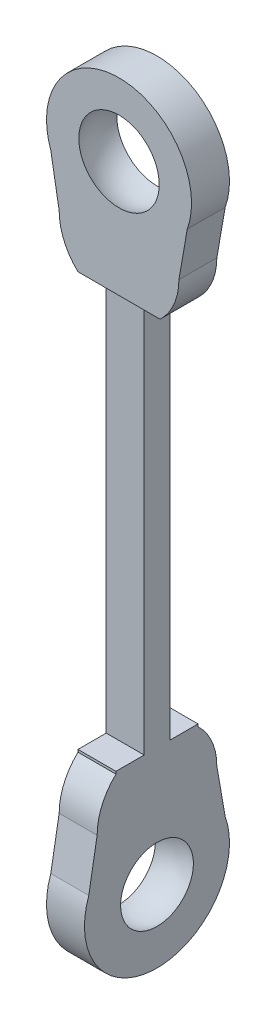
ISO-10303-21;
HEADER;
FILE_DESCRIPTION(('STEP AP214'),'2;1');
FILE_NAME('part.step','',(''),(''),'','','');
FILE_SCHEMA(('AUTOMOTIVE_DESIGN { 1 0 10303 214 1 1 1 1 }'));
ENDSEC;
DATA;
#1=APPLICATION_CONTEXT('core data for automotive mechanical design processes');
#2=APPLICATION_PROTOCOL_DEFINITION('international standard','automotive_design',2000,#1);
#3=PRODUCT_CONTEXT('',#1,'mechanical');
#4=PRODUCT('Part','Part','',(#3));
#5=PRODUCT_RELATED_PRODUCT_CATEGORY('part','',(#4));
#6=PRODUCT_DEFINITION_FORMATION('','',#4);
#7=PRODUCT_DEFINITION_CONTEXT('part definition',#1,'design');
#8=PRODUCT_DEFINITION('design','',#6,#7);
#9=PRODUCT_DEFINITION_SHAPE('','',#8);
#10=(LENGTH_UNIT() NAMED_UNIT(*) SI_UNIT(.MILLI.,.METRE.));
#11=(NAMED_UNIT(*) PLANE_ANGLE_UNIT() SI_UNIT($,.RADIAN.));
#12=(NAMED_UNIT(*) SI_UNIT($,.STERADIAN.) SOLID_ANGLE_UNIT());
#13=UNCERTAINTY_MEASURE_WITH_UNIT(LENGTH_MEASURE(1.E-05),#10,'distance_accuracy_value','');
#14=(GEOMETRIC_REPRESENTATION_CONTEXT(3) GLOBAL_UNCERTAINTY_ASSIGNED_CONTEXT((#13)) GLOBAL_UNIT_ASSIGNED_CONTEXT((#10,
#11,#12)) REPRESENTATION_CONTEXT('',''));
#15=CARTESIAN_POINT('',(0.,0.,0.));
#16=DIRECTION('',(0.,0.,1.));
#17=DIRECTION('',(1.,0.,0.));
#18=AXIS2_PLACEMENT_3D('',#15,#16,#17);
#19=CARTESIAN_POINT('',(2.,-30.5,1.42450000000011));
#20=DIRECTION('',(-1.,0.,0.));
#21=DIRECTION('',(0.,0.,1.));
#22=AXIS2_PLACEMENT_3D('',#19,#20,#21);
#23=CYLINDRICAL_SURFACE('',#22,3.532);
#24=DIRECTION('',(-1.,0.,0.));
#25=VECTOR('',#24,1.);
#26=CARTESIAN_POINT('',(2.,-29.3043678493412,4.7479752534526));
#27=LINE('',#26,#25);
#28=CARTESIAN_POINT('',(0.925000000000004,-29.3043678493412,4.7479752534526));
#29=VERTEX_POINT('',#28);
#30=CARTESIAN_POINT('',(-0.924999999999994,-29.3043678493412,4.7479752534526));
#31=VERTEX_POINT('',#30);
#32=EDGE_CURVE('E235',#29,#31,#27,.T.);
#33=ORIENTED_EDGE('',*,*,#32,.T.);
#34=CARTESIAN_POINT('',(-0.924999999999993,-30.5,1.42450000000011));
#35=DIRECTION('',(-1.,0.,0.));
#36=DIRECTION('',(0.,-1.,0.));
#37=AXIS2_PLACEMENT_3D('',#34,#35,#36);
#38=CIRCLE('',#37,3.532);
#39=CARTESIAN_POINT('',(-0.924999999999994,-29.3043678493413,-1.8989752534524));
#40=VERTEX_POINT('',#39);
#41=EDGE_CURVE('E319',#31,#40,#38,.F.);
#42=ORIENTED_EDGE('',*,*,#41,.T.);
#43=DIRECTION('',(-1.,0.,0.));
#44=VECTOR('',#43,1.);
#45=CARTESIAN_POINT('',(2.,-29.3043678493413,-1.8989752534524));
#46=LINE('',#45,#44);
#47=CARTESIAN_POINT('',(0.925000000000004,-29.3043678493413,-1.8989752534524));
#48=VERTEX_POINT('',#47);
#49=EDGE_CURVE('E236',#48,#40,#46,.T.);
#50=ORIENTED_EDGE('',*,*,#49,.F.);
#51=CARTESIAN_POINT('',(0.925000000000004,-30.5,1.42450000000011));
#52=DIRECTION('',(1.,0.,0.));
#53=DIRECTION('',(0.,1.,0.));
#54=AXIS2_PLACEMENT_3D('',#51,#52,#53);
#55=CIRCLE('',#54,3.532);
#56=EDGE_CURVE('E296',#48,#29,#55,.F.);
#57=ORIENTED_EDGE('',*,*,#56,.T.);
#58=EDGE_LOOP('',(#33,#42,#50,#57));
#59=FACE_BOUND('',#58,.T.);
#60=ADVANCED_FACE('F43',(#59),#23,.T.);
#61=CARTESIAN_POINT('',(2.,-26.968,-1.49149999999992));
#62=DIRECTION('',(0.,0.171811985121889,-0.985129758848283));
#63=DIRECTION('',(0.,0.985129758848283,0.171811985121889));
#64=AXIS2_PLACEMENT_3D('',#61,#62,#63);
#65=PLANE('',#64);
#66=ORIENTED_EDGE('',*,*,#49,.T.);
#67=DIRECTION('',(0.,0.985129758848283,0.171811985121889));
#68=VECTOR('',#67,1.);
#69=CARTESIAN_POINT('',(-0.924999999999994,-26.968,-1.49149999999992));
#70=LINE('',#69,#68);
#71=CARTESIAN_POINT('',(-0.924999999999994,-26.968,-1.49149999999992));
#72=VERTEX_POINT('',#71);
#73=EDGE_CURVE('E316',#40,#72,#70,.T.);
#74=ORIENTED_EDGE('',*,*,#73,.T.);
#75=DIRECTION('',(-1.,0.,0.));
#76=VECTOR('',#75,1.);
#77=CARTESIAN_POINT('',(2.,-26.968,-1.49149999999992));
#78=LINE('',#77,#76);
#79=CARTESIAN_POINT('',(0.925000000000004,-26.968,-1.49149999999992));
#80=VERTEX_POINT('',#79);
#81=EDGE_CURVE('E240',#80,#72,#78,.T.);
#82=ORIENTED_EDGE('',*,*,#81,.F.);
#83=DIRECTION('',(0.,-0.985129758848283,-0.171811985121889));
#84=VECTOR('',#83,1.);
#85=CARTESIAN_POINT('',(0.925000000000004,-26.968,-1.49149999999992));
#86=LINE('',#85,#84);
#87=EDGE_CURVE('E293',#80,#48,#86,.T.);
#88=ORIENTED_EDGE('',*,*,#87,.T.);
#89=EDGE_LOOP('',(#66,#74,#82,#88));
#90=FACE_BOUND('',#89,.T.);
#91=ADVANCED_FACE('F347',(#90),#65,.T.);
#92=CARTESIAN_POINT('',(2.,-26.968,1.42450000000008));
#93=DIRECTION('',(-1.,0.,0.));
#94=DIRECTION('',(0.,0.,1.));
#95=AXIS2_PLACEMENT_3D('',#92,#93,#94);
#96=CYLINDRICAL_SURFACE('',#95,2.916);
#97=ORIENTED_EDGE('',*,*,#81,.T.);
#98=CARTESIAN_POINT('',(-0.924999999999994,-26.968,1.42450000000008));
#99=DIRECTION('',(-1.,0.,0.));
#100=DIRECTION('',(0.,-1.,0.));
#101=AXIS2_PLACEMENT_3D('',#98,#99,#100);
#102=CIRCLE('',#101,2.916);
#103=CARTESIAN_POINT('',(-0.924999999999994,-24.8459594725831,-0.575499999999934));
#104=VERTEX_POINT('',#103);
#105=EDGE_CURVE('E313',#72,#104,#102,.F.);
#106=ORIENTED_EDGE('',*,*,#105,.T.);
#107=DIRECTION('',(-1.,0.,0.));
#108=VECTOR('',#107,1.);
#109=CARTESIAN_POINT('',(2.,-24.8459594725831,-0.575499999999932));
#110=LINE('',#109,#108);
#111=CARTESIAN_POINT('',(0.925000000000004,-24.8459594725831,-0.575499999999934));
#112=VERTEX_POINT('',#111);
#113=EDGE_CURVE('E243',#112,#104,#110,.T.);
#114=ORIENTED_EDGE('',*,*,#113,.F.);
#115=CARTESIAN_POINT('',(0.925000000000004,-26.968,1.42450000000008));
#116=DIRECTION('',(1.,0.,0.));
#117=DIRECTION('',(0.,1.,0.));
#118=AXIS2_PLACEMENT_3D('',#115,#116,#117);
#119=CIRCLE('',#118,2.916);
#120=EDGE_CURVE('E290',#112,#80,#119,.F.);
#121=ORIENTED_EDGE('',*,*,#120,.T.);
#122=EDGE_LOOP('',(#97,#106,#114,#121));
#123=FACE_BOUND('',#122,.T.);
#124=ADVANCED_FACE('F344',(#123),#96,.T.);
#125=CARTESIAN_POINT('',(2.,-15.25,-0.5755));
#126=DIRECTION('',(0.,0.,-1.));
#127=DIRECTION('',(0.,1.,0.));
#128=AXIS2_PLACEMENT_3D('',#125,#126,#127);
#129=PLANE('',#128);
#130=ORIENTED_EDGE('',*,*,#113,.T.);
#131=DIRECTION('',(0.,1.,0.));
#132=VECTOR('',#131,1.);
#133=CARTESIAN_POINT('',(-0.924999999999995,-15.25,-0.5755));
#134=LINE('',#133,#132);
#135=CARTESIAN_POINT('',(-0.924999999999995,-24.7275309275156,-0.575499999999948));
#136=VERTEX_POINT('',#135);
#137=EDGE_CURVE('E310',#104,#136,#134,.T.);
#138=ORIENTED_EDGE('',*,*,#137,.T.);
#139=DIRECTION('',(-1.,0.,0.));
#140=VECTOR('',#139,1.);
#141=CARTESIAN_POINT('',(2.,-24.7275309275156,-0.575499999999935));
#142=LINE('',#141,#140);
#143=CARTESIAN_POINT('',(0.925000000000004,-24.7275309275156,-0.575499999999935));
#144=VERTEX_POINT('',#143);
#145=EDGE_CURVE('E206',#144,#136,#142,.T.);
#146=ORIENTED_EDGE('',*,*,#145,.F.);
#147=DIRECTION('',(0.,-1.,0.));
#148=VECTOR('',#147,1.);
#149=CARTESIAN_POINT('',(0.925000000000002,-15.25,-0.5755));
#150=LINE('',#149,#148);
#151=EDGE_CURVE('E67',#144,#112,#150,.T.);
#152=ORIENTED_EDGE('',*,*,#151,.T.);
#153=EDGE_LOOP('',(#130,#138,#146,#152));
#154=FACE_BOUND('',#153,.T.);
#155=ADVANCED_FACE('F341',(#154),#129,.T.);
#156=CARTESIAN_POINT('',(2.,-24.845959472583,3.42450000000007));
#157=DIRECTION('',(0.,0.,1.));
#158=DIRECTION('',(0.,-1.,0.));
#159=AXIS2_PLACEMENT_3D('',#156,#157,#158);
#160=PLANE('',#159);
#161=DIRECTION('',(1.,0.,0.));
#162=VECTOR('',#161,1.);
#163=CARTESIAN_POINT('',(2.,-24.7275309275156,3.42450000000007));
#164=LINE('',#163,#162);
#165=CARTESIAN_POINT('',(-0.924999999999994,-24.7275309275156,3.42450000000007));
#166=VERTEX_POINT('',#165);
#167=CARTESIAN_POINT('',(0.925000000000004,-24.7275309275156,3.42450000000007));
#168=VERTEX_POINT('',#167);
#169=EDGE_CURVE('E203',#166,#168,#164,.T.);
#170=ORIENTED_EDGE('',*,*,#169,.F.);
#171=DIRECTION('',(0.,-1.,0.));
#172=VECTOR('',#171,1.);
#173=CARTESIAN_POINT('',(-0.924999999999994,-24.845959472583,3.42450000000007));
#174=LINE('',#173,#172);
#175=CARTESIAN_POINT('',(-0.924999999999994,-24.845959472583,3.42450000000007));
#176=VERTEX_POINT('',#175);
#177=EDGE_CURVE('E328',#166,#176,#174,.T.);
#178=ORIENTED_EDGE('',*,*,#177,.T.);
#179=DIRECTION('',(-1.,0.,0.));
#180=VECTOR('',#179,1.);
#181=CARTESIAN_POINT('',(2.,-24.845959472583,3.42450000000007));
#182=LINE('',#181,#180);
#183=CARTESIAN_POINT('',(0.925000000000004,-24.845959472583,3.42450000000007));
#184=VERTEX_POINT('',#183);
#185=EDGE_CURVE('E246',#184,#176,#182,.T.);
#186=ORIENTED_EDGE('',*,*,#185,.F.);
#187=DIRECTION('',(0.,1.,0.));
#188=VECTOR('',#187,1.);
#189=CARTESIAN_POINT('',(0.925000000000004,-24.845959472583,3.42450000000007));
#190=LINE('',#189,#188);
#191=EDGE_CURVE('E305',#184,#168,#190,.T.);
#192=ORIENTED_EDGE('',*,*,#191,.T.);
#193=EDGE_LOOP('',(#170,#178,#186,#192));
#194=FACE_BOUND('',#193,.T.);
#195=ADVANCED_FACE('F360',(#194),#160,.T.);
#196=CARTESIAN_POINT('',(2.,-26.968,1.42450000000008));
#197=DIRECTION('',(-1.,0.,0.));
#198=DIRECTION('',(0.,0.,1.));
#199=AXIS2_PLACEMENT_3D('',#196,#197,#198);
#200=CYLINDRICAL_SURFACE('',#199,2.91600000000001);
#201=ORIENTED_EDGE('',*,*,#185,.T.);
#202=CARTESIAN_POINT('',(-0.924999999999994,-26.968,1.42450000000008));
#203=DIRECTION('',(-1.,0.,0.));
#204=DIRECTION('',(0.,-1.,0.));
#205=AXIS2_PLACEMENT_3D('',#202,#203,#204);
#206=CIRCLE('',#205,2.91600000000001);
#207=CARTESIAN_POINT('',(-0.924999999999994,-26.968,4.34050000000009));
#208=VERTEX_POINT('',#207);
#209=EDGE_CURVE('E325',#176,#208,#206,.F.);
#210=ORIENTED_EDGE('',*,*,#209,.T.);
#211=DIRECTION('',(-1.,0.,0.));
#212=VECTOR('',#211,1.);
#213=CARTESIAN_POINT('',(2.,-26.968,4.34050000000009));
#214=LINE('',#213,#212);
#215=CARTESIAN_POINT('',(0.925000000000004,-26.968,4.34050000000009));
#216=VERTEX_POINT('',#215);
#217=EDGE_CURVE('E249',#216,#208,#214,.T.);
#218=ORIENTED_EDGE('',*,*,#217,.F.);
#219=CARTESIAN_POINT('',(0.925000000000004,-26.968,1.42450000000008));
#220=DIRECTION('',(1.,0.,0.));
#221=DIRECTION('',(0.,1.,0.));
#222=AXIS2_PLACEMENT_3D('',#219,#220,#221);
#223=CIRCLE('',#222,2.91600000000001);
#224=EDGE_CURVE('E302',#216,#184,#223,.F.);
#225=ORIENTED_EDGE('',*,*,#224,.T.);
#226=EDGE_LOOP('',(#201,#210,#218,#225));
#227=FACE_BOUND('',#226,.T.);
#228=ADVANCED_FACE('F355',(#227),#200,.T.);
#229=CARTESIAN_POINT('',(2.,-29.3043678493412,4.7479752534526));
#230=DIRECTION('',(0.,0.171811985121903,0.98512975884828));
#231=DIRECTION('',(0.,-0.98512975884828,0.171811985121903));
#232=AXIS2_PLACEMENT_3D('',#229,#230,#231);
#233=PLANE('',#232);
#234=ORIENTED_EDGE('',*,*,#217,.T.);
#235=DIRECTION('',(0.,-0.98512975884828,0.171811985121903));
#236=VECTOR('',#235,1.);
#237=CARTESIAN_POINT('',(-0.924999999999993,-29.3043678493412,4.7479752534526));
#238=LINE('',#237,#236);
#239=EDGE_CURVE('E322',#208,#31,#238,.T.);
#240=ORIENTED_EDGE('',*,*,#239,.T.);
#241=ORIENTED_EDGE('',*,*,#32,.F.);
#242=DIRECTION('',(0.,0.98512975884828,-0.171811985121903));
#243=VECTOR('',#242,1.);
#244=CARTESIAN_POINT('',(0.925000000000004,-29.3043678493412,4.7479752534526));
#245=LINE('',#244,#243);
#246=EDGE_CURVE('E299',#29,#216,#245,.T.);
#247=ORIENTED_EDGE('',*,*,#246,.T.);
#248=EDGE_LOOP('',(#234,#240,#241,#247));
#249=FACE_BOUND('',#248,.T.);
#250=ADVANCED_FACE('F352',(#249),#233,.T.);
#251=CARTESIAN_POINT('',(12.,-5.65404052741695,2.049));
#252=DIRECTION('',(0.,0.,-1.));
#253=DIRECTION('',(0.,1.,0.));
#254=AXIS2_PLACEMENT_3D('',#251,#252,#253);
#255=PLANE('',#254);
#256=DIRECTION('',(0.,1.,0.));
#257=VECTOR('',#256,1.);
#258=CARTESIAN_POINT('',(-0.924999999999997,-5.65404052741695,2.049));
#259=LINE('',#258,#257);
#260=CARTESIAN_POINT('',(-0.924999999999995,-24.7275309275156,2.04900000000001));
#261=VERTEX_POINT('',#260);
#262=CARTESIAN_POINT('',(-0.924999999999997,-5.65404052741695,2.049));
#263=VERTEX_POINT('',#262);
#264=EDGE_CURVE('E199',#261,#263,#259,.T.);
#265=ORIENTED_EDGE('',*,*,#264,.F.);
#266=DIRECTION('',(-1.,0.,0.));
#267=VECTOR('',#266,1.);
#268=CARTESIAN_POINT('',(12.,-24.7275309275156,2.04900000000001));
#269=LINE('',#268,#267);
#270=CARTESIAN_POINT('',(0.925000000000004,-24.7275309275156,2.04900000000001));
#271=VERTEX_POINT('',#270);
#272=EDGE_CURVE('E188',#271,#261,#269,.T.);
#273=ORIENTED_EDGE('',*,*,#272,.F.);
#274=DIRECTION('',(0.,-1.,0.));
#275=VECTOR('',#274,1.);
#276=CARTESIAN_POINT('',(0.925000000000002,-5.65404052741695,2.049));
#277=LINE('',#276,#275);
#278=CARTESIAN_POINT('',(0.925000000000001,-5.65404052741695,2.049));
#279=VERTEX_POINT('',#278);
#280=EDGE_CURVE('E170',#279,#271,#277,.T.);
#281=ORIENTED_EDGE('',*,*,#280,.F.);
#282=DIRECTION('',(-1.,0.,0.));
#283=VECTOR('',#282,1.);
#284=CARTESIAN_POINT('',(12.,-5.65404052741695,2.049));
#285=LINE('',#284,#283);
#286=EDGE_CURVE('E186',#279,#263,#285,.T.);
#287=ORIENTED_EDGE('',*,*,#286,.T.);
#288=EDGE_LOOP('',(#265,#273,#281,#287));
#289=FACE_BOUND('',#288,.T.);
#290=ADVANCED_FACE('F185',(#289),#255,.F.);
#291=CARTESIAN_POINT('',(12.,-24.7275309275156,2.04900000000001));
#292=DIRECTION('',(0.,-1.,0.));
#293=DIRECTION('',(0.,0.,-1.));
#294=AXIS2_PLACEMENT_3D('',#291,#292,#293);
#295=PLANE('',#294);
#296=DIRECTION('',(0.,0.,-1.));
#297=VECTOR('',#296,1.);
#298=CARTESIAN_POINT('',(-0.924999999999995,-24.7275309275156,2.04900000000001));
#299=LINE('',#298,#297);
#300=EDGE_CURVE('E331',#166,#261,#299,.T.);
#301=ORIENTED_EDGE('',*,*,#300,.F.);
#302=ORIENTED_EDGE('',*,*,#169,.T.);
#303=DIRECTION('',(0.,0.,1.));
#304=VECTOR('',#303,1.);
#305=CARTESIAN_POINT('',(0.925000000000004,-24.7275309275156,2.04900000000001));
#306=LINE('',#305,#304);
#307=EDGE_CURVE('E189',#271,#168,#306,.T.);
#308=ORIENTED_EDGE('',*,*,#307,.F.);
#309=ORIENTED_EDGE('',*,*,#272,.T.);
#310=EDGE_LOOP('',(#301,#302,#308,#309));
#311=FACE_BOUND('',#310,.T.);
#312=ADVANCED_FACE('F362',(#311),#295,.F.);
#313=CARTESIAN_POINT('',(12.,-5.65404052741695,0.800000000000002));
#314=DIRECTION('',(0.,0.,1.));
#315=DIRECTION('',(0.,-1.,0.));
#316=AXIS2_PLACEMENT_3D('',#313,#314,#315);
#317=PLANE('',#316);
#318=DIRECTION('',(0.,-1.,0.));
#319=VECTOR('',#318,1.);
#320=CARTESIAN_POINT('',(-0.924999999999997,-5.65404052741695,0.800000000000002));
#321=LINE('',#320,#319);
#322=CARTESIAN_POINT('',(-0.924999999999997,-5.65404052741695,0.800000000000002));
#323=VERTEX_POINT('',#322);
#324=CARTESIAN_POINT('',(-0.924999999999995,-24.7275309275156,0.800000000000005));
#325=VERTEX_POINT('',#324);
#326=EDGE_CURVE('E59',#323,#325,#321,.T.);
#327=ORIENTED_EDGE('',*,*,#326,.F.);
#328=DIRECTION('',(-1.,0.,0.));
#329=VECTOR('',#328,1.);
#330=CARTESIAN_POINT('',(12.,-5.65404052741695,0.800000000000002));
#331=LINE('',#330,#329);
#332=CARTESIAN_POINT('',(0.925000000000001,-5.65404052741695,0.800000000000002));
#333=VERTEX_POINT('',#332);
#334=EDGE_CURVE('E197',#333,#323,#331,.T.);
#335=ORIENTED_EDGE('',*,*,#334,.F.);
#336=DIRECTION('',(0.,1.,0.));
#337=VECTOR('',#336,1.);
#338=CARTESIAN_POINT('',(0.925000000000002,-5.65404052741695,0.800000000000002));
#339=LINE('',#338,#337);
#340=CARTESIAN_POINT('',(0.925000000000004,-24.7275309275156,0.800000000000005));
#341=VERTEX_POINT('',#340);
#342=EDGE_CURVE('E173',#341,#333,#339,.T.);
#343=ORIENTED_EDGE('',*,*,#342,.F.);
#344=DIRECTION('',(-1.,0.,0.));
#345=VECTOR('',#344,1.);
#346=CARTESIAN_POINT('',(12.,-24.7275309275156,0.800000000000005));
#347=LINE('',#346,#345);
#348=EDGE_CURVE('E194',#341,#325,#347,.T.);
#349=ORIENTED_EDGE('',*,*,#348,.T.);
#350=EDGE_LOOP('',(#327,#335,#343,#349));
#351=FACE_BOUND('',#350,.T.);
#352=ADVANCED_FACE('F334',(#351),#317,.F.);
#353=CARTESIAN_POINT('',(12.,-24.7275309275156,0.800000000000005));
#354=DIRECTION('',(0.,-1.,0.));
#355=DIRECTION('',(0.,0.,-1.));
#356=AXIS2_PLACEMENT_3D('',#353,#354,#355);
#357=PLANE('',#356);
#358=DIRECTION('',(0.,0.,-1.));
#359=VECTOR('',#358,1.);
#360=CARTESIAN_POINT('',(-0.924999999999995,-24.7275309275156,0.800000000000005));
#361=LINE('',#360,#359);
#362=EDGE_CURVE('E11',#325,#136,#361,.T.);
#363=ORIENTED_EDGE('',*,*,#362,.F.);
#364=ORIENTED_EDGE('',*,*,#348,.F.);
#365=DIRECTION('',(0.,0.,1.));
#366=VECTOR('',#365,1.);
#367=CARTESIAN_POINT('',(0.925000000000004,-24.7275309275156,0.800000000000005));
#368=LINE('',#367,#366);
#369=EDGE_CURVE('E52',#144,#341,#368,.T.);
#370=ORIENTED_EDGE('',*,*,#369,.F.);
#371=ORIENTED_EDGE('',*,*,#145,.T.);
#372=EDGE_LOOP('',(#363,#364,#370,#371));
#373=FACE_BOUND('',#372,.T.);
#374=ADVANCED_FACE('F337',(#373),#357,.F.);
#375=CARTESIAN_POINT('',(0.,-3.532,-8.47167746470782));
#376=DIRECTION('',(0.,0.,1.));
#377=DIRECTION('',(1.,0.,0.));
#378=AXIS2_PLACEMENT_3D('',#375,#376,#377);
#379=CYLINDRICAL_SURFACE('',#378,2.916);
#380=CARTESIAN_POINT('',(0.,-3.532,0.500000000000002));
#381=DIRECTION('',(0.,0.,1.));
#382=DIRECTION('',(0.,-1.,0.));
#383=AXIS2_PLACEMENT_3D('',#380,#381,#382);
#384=CIRCLE('',#383,2.916);
#385=CARTESIAN_POINT('',(-2.,-5.65404052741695,0.500000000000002));
#386=VERTEX_POINT('',#385);
#387=CARTESIAN_POINT('',(-2.916,-3.53200000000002,0.500000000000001));
#388=VERTEX_POINT('',#387);
#389=EDGE_CURVE('E233',#386,#388,#384,.F.);
#390=ORIENTED_EDGE('',*,*,#389,.F.);
#391=DIRECTION('',(0.,0.,1.));
#392=VECTOR('',#391,1.);
#393=CARTESIAN_POINT('',(-2.,-5.65404052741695,-2.15182983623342));
#394=LINE('',#393,#392);
#395=CARTESIAN_POINT('',(-2.,-5.65404052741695,2.349));
#396=VERTEX_POINT('',#395);
#397=EDGE_CURVE('E256',#386,#396,#394,.T.);
#398=ORIENTED_EDGE('',*,*,#397,.T.);
#399=CARTESIAN_POINT('',(0.,-3.532,2.349));
#400=DIRECTION('',(0.,0.,-1.));
#401=DIRECTION('',(0.,1.,0.));
#402=AXIS2_PLACEMENT_3D('',#399,#400,#401);
#403=CIRCLE('',#402,2.916);
#404=CARTESIAN_POINT('',(-2.916,-3.53200000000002,2.349));
#405=VERTEX_POINT('',#404);
#406=EDGE_CURVE('E219',#405,#396,#403,.F.);
#407=ORIENTED_EDGE('',*,*,#406,.F.);
#408=DIRECTION('',(0.,0.,1.));
#409=VECTOR('',#408,1.);
#410=CARTESIAN_POINT('',(-2.916,-3.53200000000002,-8.47167746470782));
#411=LINE('',#410,#409);
#412=EDGE_CURVE('E258',#388,#405,#411,.T.);
#413=ORIENTED_EDGE('',*,*,#412,.F.);
#414=EDGE_LOOP('',(#390,#398,#407,#413));
#415=FACE_BOUND('',#414,.T.);
#416=ADVANCED_FACE('F388',(#415),#379,.T.);
#417=CARTESIAN_POINT('',(0.,-3.532,0.500000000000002));
#418=DIRECTION('',(0.,0.,1.));
#419=DIRECTION('',(0.,-1.,0.));
#420=AXIS2_PLACEMENT_3D('',#417,#418,#419);
#421=CIRCLE('',#420,2.916);
#422=CARTESIAN_POINT('',(2.916,-3.532,0.500000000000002));
#423=VERTEX_POINT('',#422);
#424=CARTESIAN_POINT('',(2.,-5.65404052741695,0.500000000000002));
#425=VERTEX_POINT('',#424);
#426=EDGE_CURVE('E222',#423,#425,#421,.F.);
#427=ORIENTED_EDGE('',*,*,#426,.F.);
#428=DIRECTION('',(0.,0.,1.));
#429=VECTOR('',#428,1.);
#430=CARTESIAN_POINT('',(2.916,-3.532,-8.47167746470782));
#431=LINE('',#430,#429);
#432=CARTESIAN_POINT('',(2.916,-3.532,2.349));
#433=VERTEX_POINT('',#432);
#434=EDGE_CURVE('E266',#423,#433,#431,.T.);
#435=ORIENTED_EDGE('',*,*,#434,.T.);
#436=CARTESIAN_POINT('',(0.,-3.532,2.349));
#437=DIRECTION('',(0.,0.,-1.));
#438=DIRECTION('',(0.,1.,0.));
#439=AXIS2_PLACEMENT_3D('',#436,#437,#438);
#440=CIRCLE('',#439,2.916);
#441=CARTESIAN_POINT('',(2.,-5.65404052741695,2.349));
#442=VERTEX_POINT('',#441);
#443=EDGE_CURVE('E209',#442,#433,#440,.F.);
#444=ORIENTED_EDGE('',*,*,#443,.F.);
#445=DIRECTION('',(0.,0.,1.));
#446=VECTOR('',#445,1.);
#447=CARTESIAN_POINT('',(2.,-5.65404052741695,-2.15182983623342));
#448=LINE('',#447,#446);
#449=EDGE_CURVE('E239',#425,#442,#448,.T.);
#450=ORIENTED_EDGE('',*,*,#449,.F.);
#451=EDGE_LOOP('',(#427,#435,#444,#450));
#452=FACE_BOUND('',#451,.T.);
#453=ADVANCED_FACE('F390',(#452),#379,.T.);
#454=CARTESIAN_POINT('',(0.,0.,2.849));
#455=DIRECTION('',(0.,0.,-1.));
#456=DIRECTION('',(-1.,0.,0.));
#457=AXIS2_PLACEMENT_3D('',#454,#455,#456);
#458=CYLINDRICAL_SURFACE('',#457,3.532);
#459=DIRECTION('',(0.,0.,1.));
#460=VECTOR('',#459,1.);
#461=CARTESIAN_POINT('',(3.3234752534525,-1.19563215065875,-8.47167746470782));
#462=LINE('',#461,#460);
#463=CARTESIAN_POINT('',(3.32347525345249,-1.19563215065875,0.500000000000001));
#464=VERTEX_POINT('',#463);
#465=CARTESIAN_POINT('',(3.32347525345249,-1.19563215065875,2.349));
#466=VERTEX_POINT('',#465);
#467=EDGE_CURVE('E263',#464,#466,#462,.T.);
#468=ORIENTED_EDGE('',*,*,#467,.F.);
#469=CARTESIAN_POINT('',(0.,0.,0.500000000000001));
#470=DIRECTION('',(0.,0.,1.));
#471=DIRECTION('',(0.,-1.,0.));
#472=AXIS2_PLACEMENT_3D('',#469,#470,#471);
#473=CIRCLE('',#472,3.532);
#474=CARTESIAN_POINT('',(-3.3234752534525,-1.19563215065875,0.500000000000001));
#475=VERTEX_POINT('',#474);
#476=EDGE_CURVE('E227',#464,#475,#473,.T.);
#477=ORIENTED_EDGE('',*,*,#476,.T.);
#478=DIRECTION('',(0.,0.,1.));
#479=VECTOR('',#478,1.);
#480=CARTESIAN_POINT('',(-3.3234752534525,-1.19563215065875,-8.47167746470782));
#481=LINE('',#480,#479);
#482=CARTESIAN_POINT('',(-3.3234752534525,-1.19563215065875,2.349));
#483=VERTEX_POINT('',#482);
#484=EDGE_CURVE('E259',#475,#483,#481,.T.);
#485=ORIENTED_EDGE('',*,*,#484,.T.);
#486=CARTESIAN_POINT('',(0.,0.,2.349));
#487=DIRECTION('',(0.,0.,-1.));
#488=DIRECTION('',(0.,1.,0.));
#489=AXIS2_PLACEMENT_3D('',#486,#487,#488);
#490=CIRCLE('',#489,3.532);
#491=EDGE_CURVE('E213',#483,#466,#490,.T.);
#492=ORIENTED_EDGE('',*,*,#491,.T.);
#493=EDGE_LOOP('',(#468,#477,#485,#492));
#494=FACE_BOUND('',#493,.T.);
#495=ADVANCED_FACE('F45',(#494),#458,.T.);
#496=CARTESIAN_POINT('',(-3.42773762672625,-0.597816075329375,-8.47167746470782));
#497=DIRECTION('',(0.985129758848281,0.171811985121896,0.));
#498=DIRECTION('',(-0.171811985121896,0.985129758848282,0.));
#499=AXIS2_PLACEMENT_3D('',#496,#497,#498);
#500=PLANE('',#499);
#501=ORIENTED_EDGE('',*,*,#484,.F.);
#502=DIRECTION('',(0.171811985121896,-0.985129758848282,0.));
#503=VECTOR('',#502,1.);
#504=CARTESIAN_POINT('',(-3.42773762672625,-0.597816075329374,0.5));
#505=LINE('',#504,#503);
#506=EDGE_CURVE('E230',#475,#388,#505,.T.);
#507=ORIENTED_EDGE('',*,*,#506,.T.);
#508=ORIENTED_EDGE('',*,*,#412,.T.);
#509=DIRECTION('',(-0.171811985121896,0.985129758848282,0.));
#510=VECTOR('',#509,1.);
#511=CARTESIAN_POINT('',(-3.42773762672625,-0.597816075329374,2.349));
#512=LINE('',#511,#510);
#513=EDGE_CURVE('E216',#405,#483,#512,.T.);
#514=ORIENTED_EDGE('',*,*,#513,.T.);
#515=EDGE_LOOP('',(#501,#507,#508,#514));
#516=FACE_BOUND('',#515,.T.);
#517=ADVANCED_FACE('F386',(#516),#500,.F.);
#518=CARTESIAN_POINT('',(3.42773762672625,-0.597816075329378,-8.47167746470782));
#519=DIRECTION('',(0.985129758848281,-0.171811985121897,0.));
#520=DIRECTION('',(0.171811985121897,0.985129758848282,0.));
#521=AXIS2_PLACEMENT_3D('',#518,#519,#520);
#522=PLANE('',#521);
#523=DIRECTION('',(-0.171811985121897,-0.985129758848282,0.));
#524=VECTOR('',#523,1.);
#525=CARTESIAN_POINT('',(3.42773762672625,-0.597816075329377,0.5));
#526=LINE('',#525,#524);
#527=EDGE_CURVE('E225',#464,#423,#526,.T.);
#528=ORIENTED_EDGE('',*,*,#527,.F.);
#529=ORIENTED_EDGE('',*,*,#467,.T.);
#530=DIRECTION('',(0.171811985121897,0.985129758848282,0.));
#531=VECTOR('',#530,1.);
#532=CARTESIAN_POINT('',(3.42773762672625,-0.597816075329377,2.349));
#533=LINE('',#532,#531);
#534=EDGE_CURVE('E211',#433,#466,#533,.T.);
#535=ORIENTED_EDGE('',*,*,#534,.F.);
#536=ORIENTED_EDGE('',*,*,#434,.F.);
#537=EDGE_LOOP('',(#528,#529,#535,#536));
#538=FACE_BOUND('',#537,.T.);
#539=ADVANCED_FACE('F382',(#538),#522,.T.);
#540=CARTESIAN_POINT('',(12.,4.12414366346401,2.349));
#541=DIRECTION('',(0.,0.,-1.));
#542=DIRECTION('',(0.,1.,0.));
#543=AXIS2_PLACEMENT_3D('',#540,#541,#542);
#544=PLANE('',#543);
#545=CARTESIAN_POINT('',(0.,0.,2.349));
#546=DIRECTION('',(0.,0.,-1.));
#547=DIRECTION('',(0.,1.,0.));
#548=AXIS2_PLACEMENT_3D('',#545,#546,#547);
#549=CIRCLE('',#548,1.95768351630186);
#550=CARTESIAN_POINT('',(0.,1.95768351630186,2.349));
#551=VERTEX_POINT('',#550);
#552=EDGE_CURVE('E179',#551,#551,#549,.T.);
#553=ORIENTED_EDGE('',*,*,#552,.T.);
#554=EDGE_LOOP('',(#553));
#555=FACE_BOUND('',#554,.T.);
#556=ORIENTED_EDGE('',*,*,#406,.T.);
#557=DIRECTION('',(1.,0.,0.));
#558=VECTOR('',#557,1.);
#559=CARTESIAN_POINT('',(12.,-5.65404052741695,2.349));
#560=LINE('',#559,#558);
#561=EDGE_CURVE('E272',#396,#442,#560,.T.);
#562=ORIENTED_EDGE('',*,*,#561,.T.);
#563=ORIENTED_EDGE('',*,*,#443,.T.);
#564=ORIENTED_EDGE('',*,*,#534,.T.);
#565=ORIENTED_EDGE('',*,*,#491,.F.);
#566=ORIENTED_EDGE('',*,*,#513,.F.);
#567=EDGE_LOOP('',(#556,#562,#563,#564,#565,#566));
#568=FACE_BOUND('',#567,.T.);
#569=ADVANCED_FACE('F385',(#555,#568),#544,.F.);
#570=CARTESIAN_POINT('',(12.,4.12414366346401,0.5));
#571=DIRECTION('',(0.,0.,1.));
#572=DIRECTION('',(0.,-1.,0.));
#573=AXIS2_PLACEMENT_3D('',#570,#571,#572);
#574=PLANE('',#573);
#575=CARTESIAN_POINT('',(0.,0.,0.500000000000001));
#576=DIRECTION('',(0.,0.,1.));
#577=DIRECTION('',(0.,-1.,0.));
#578=AXIS2_PLACEMENT_3D('',#575,#576,#577);
#579=CIRCLE('',#578,1.95768351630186);
#580=CARTESIAN_POINT('',(0.,-1.95768351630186,0.500000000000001));
#581=VERTEX_POINT('',#580);
#582=EDGE_CURVE('E274',#581,#581,#579,.T.);
#583=ORIENTED_EDGE('',*,*,#582,.T.);
#584=EDGE_LOOP('',(#583));
#585=FACE_BOUND('',#584,.T.);
#586=ORIENTED_EDGE('',*,*,#426,.T.);
#587=DIRECTION('',(-1.,0.,0.));
#588=VECTOR('',#587,1.);
#589=CARTESIAN_POINT('',(12.,-5.65404052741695,0.500000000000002));
#590=LINE('',#589,#588);
#591=EDGE_CURVE('E262',#425,#386,#590,.T.);
#592=ORIENTED_EDGE('',*,*,#591,.T.);
#593=ORIENTED_EDGE('',*,*,#389,.T.);
#594=ORIENTED_EDGE('',*,*,#506,.F.);
#595=ORIENTED_EDGE('',*,*,#476,.F.);
#596=ORIENTED_EDGE('',*,*,#527,.T.);
#597=EDGE_LOOP('',(#586,#592,#593,#594,#595,#596));
#598=FACE_BOUND('',#597,.T.);
#599=ADVANCED_FACE('F403',(#585,#598),#574,.F.);
#600=CARTESIAN_POINT('',(12.,-5.65404052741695,-1.82909751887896));
#601=DIRECTION('',(0.,1.,0.));
#602=DIRECTION('',(0.,0.,1.));
#603=AXIS2_PLACEMENT_3D('',#600,#601,#602);
#604=PLANE('',#603);
#605=ORIENTED_EDGE('',*,*,#286,.F.);
#606=DIRECTION('',(0.,0.,-1.));
#607=VECTOR('',#606,1.);
#608=CARTESIAN_POINT('',(0.925000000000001,-5.65404052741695,26.049));
#609=LINE('',#608,#607);
#610=EDGE_CURVE('E167',#279,#333,#609,.T.);
#611=ORIENTED_EDGE('',*,*,#610,.T.);
#612=ORIENTED_EDGE('',*,*,#334,.T.);
#613=DIRECTION('',(0.,0.,-1.));
#614=VECTOR('',#613,1.);
#615=CARTESIAN_POINT('',(-0.924999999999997,-5.65404052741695,26.049));
#616=LINE('',#615,#614);
#617=EDGE_CURVE('E178',#263,#323,#616,.T.);
#618=ORIENTED_EDGE('',*,*,#617,.F.);
#619=EDGE_LOOP('',(#605,#611,#612,#618));
#620=FACE_BOUND('',#619,.T.);
#621=ORIENTED_EDGE('',*,*,#449,.T.);
#622=ORIENTED_EDGE('',*,*,#561,.F.);
#623=ORIENTED_EDGE('',*,*,#397,.F.);
#624=ORIENTED_EDGE('',*,*,#591,.F.);
#625=EDGE_LOOP('',(#621,#622,#623,#624));
#626=FACE_BOUND('',#625,.T.);
#627=ADVANCED_FACE('F192',(#620,#626),#604,.F.);
#628=CARTESIAN_POINT('',(0.925000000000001,-5.65404052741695,26.049));
#629=DIRECTION('',(1.,0.,0.));
#630=DIRECTION('',(0.,1.,0.));
#631=AXIS2_PLACEMENT_3D('',#628,#629,#630);
#632=PLANE('',#631);
#633=CARTESIAN_POINT('',(0.925000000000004,-30.5,1.42450000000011));
#634=DIRECTION('',(1.,0.,0.));
#635=DIRECTION('',(0.,1.,0.));
#636=AXIS2_PLACEMENT_3D('',#633,#634,#635);
#637=CIRCLE('',#636,1.77323856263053);
#638=CARTESIAN_POINT('',(0.925000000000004,-28.7267614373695,1.42450000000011));
#639=VERTEX_POINT('',#638);
#640=EDGE_CURVE('E276',#639,#639,#637,.T.);
#641=ORIENTED_EDGE('',*,*,#640,.F.);
#642=EDGE_LOOP('',(#641));
#643=FACE_BOUND('',#642,.T.);
#644=ORIENTED_EDGE('',*,*,#280,.T.);
#645=ORIENTED_EDGE('',*,*,#307,.T.);
#646=ORIENTED_EDGE('',*,*,#191,.F.);
#647=ORIENTED_EDGE('',*,*,#224,.F.);
#648=ORIENTED_EDGE('',*,*,#246,.F.);
#649=ORIENTED_EDGE('',*,*,#56,.F.);
#650=ORIENTED_EDGE('',*,*,#87,.F.);
#651=ORIENTED_EDGE('',*,*,#120,.F.);
#652=ORIENTED_EDGE('',*,*,#151,.F.);
#653=ORIENTED_EDGE('',*,*,#369,.T.);
#654=ORIENTED_EDGE('',*,*,#342,.T.);
#655=ORIENTED_EDGE('',*,*,#610,.F.);
#656=EDGE_LOOP('',(#644,#645,#646,#647,#648,#649,#650,#651,#652,#653,#654,#655));
#657=FACE_BOUND('',#656,.T.);
#658=ADVANCED_FACE('F169',(#643,#657),#632,.T.);
#659=CARTESIAN_POINT('',(-0.924999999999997,-5.65404052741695,26.049));
#660=DIRECTION('',(-1.,0.,0.));
#661=DIRECTION('',(0.,-1.,0.));
#662=AXIS2_PLACEMENT_3D('',#659,#660,#661);
#663=PLANE('',#662);
#664=CARTESIAN_POINT('',(-0.924999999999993,-30.5,1.42450000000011));
#665=DIRECTION('',(-1.,0.,0.));
#666=DIRECTION('',(0.,-1.,0.));
#667=AXIS2_PLACEMENT_3D('',#664,#665,#666);
#668=CIRCLE('',#667,1.77323856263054);
#669=CARTESIAN_POINT('',(-0.924999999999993,-32.2732385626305,1.42450000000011));
#670=VERTEX_POINT('',#669);
#671=EDGE_CURVE('E47',#670,#670,#668,.T.);
#672=ORIENTED_EDGE('',*,*,#671,.F.);
#673=EDGE_LOOP('',(#672));
#674=FACE_BOUND('',#673,.T.);
#675=ORIENTED_EDGE('',*,*,#264,.T.);
#676=ORIENTED_EDGE('',*,*,#617,.T.);
#677=ORIENTED_EDGE('',*,*,#326,.T.);
#678=ORIENTED_EDGE('',*,*,#362,.T.);
#679=ORIENTED_EDGE('',*,*,#137,.F.);
#680=ORIENTED_EDGE('',*,*,#105,.F.);
#681=ORIENTED_EDGE('',*,*,#73,.F.);
#682=ORIENTED_EDGE('',*,*,#41,.F.);
#683=ORIENTED_EDGE('',*,*,#239,.F.);
#684=ORIENTED_EDGE('',*,*,#209,.F.);
#685=ORIENTED_EDGE('',*,*,#177,.F.);
#686=ORIENTED_EDGE('',*,*,#300,.T.);
#687=EDGE_LOOP('',(#675,#676,#677,#678,#679,#680,#681,#682,#683,#684,#685,#686));
#688=FACE_BOUND('',#687,.T.);
#689=ADVANCED_FACE('F339',(#674,#688),#663,.T.);
#690=CARTESIAN_POINT('',(0.,0.,1.4245));
#691=DIRECTION('',(0.,1.,0.));
#692=DIRECTION('',(-1.,0.,0.));
#693=AXIS2_PLACEMENT_3D('',#690,#691,#692);
#694=SPHERICAL_SURFACE('',#693,2.165);
#695=CARTESIAN_POINT('',(0.,0.,1.4245));
#696=DIRECTION('',(0.,0.,1.));
#697=DIRECTION('',(0.,-1.,0.));
#698=AXIS2_PLACEMENT_3D('',#695,#696,#697);
#699=SPHERICAL_SURFACE('',#698,2.165);
#700=ORIENTED_EDGE('',*,*,#582,.F.);
#701=EDGE_LOOP('',(#700));
#702=FACE_BOUND('',#701,.T.);
#703=ORIENTED_EDGE('',*,*,#552,.F.);
#704=EDGE_LOOP('',(#703));
#705=FACE_BOUND('',#704,.T.);
#706=ADVANCED_FACE('F523',(#702,#705),#699,.F.);
#707=CARTESIAN_POINT('',(0.,-30.5,1.42450000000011));
#708=DIRECTION('',(0.,1.,0.));
#709=DIRECTION('',(0.,0.,1.));
#710=AXIS2_PLACEMENT_3D('',#707,#708,#709);
#711=SPHERICAL_SURFACE('',#710,2.);
#712=CARTESIAN_POINT('',(0.,-30.5,1.42450000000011));
#713=DIRECTION('',(1.,0.,0.));
#714=DIRECTION('',(0.,1.,0.));
#715=AXIS2_PLACEMENT_3D('',#712,#713,#714);
#716=SPHERICAL_SURFACE('',#715,2.);
#717=ORIENTED_EDGE('',*,*,#640,.T.);
#718=EDGE_LOOP('',(#717));
#719=FACE_BOUND('',#718,.T.);
#720=ORIENTED_EDGE('',*,*,#671,.T.);
#721=EDGE_LOOP('',(#720));
#722=FACE_BOUND('',#721,.T.);
#723=ADVANCED_FACE('F533',(#719,#722),#716,.F.);
#724=CLOSED_SHELL('',(#60,#91,#124,#155,#195,#228,#250,#290,#312,#352,#374,#416,#453,#495,#517,
#539,#569,#599,#627,#658,#689,#706,#723));
#725=MANIFOLD_SOLID_BREP('B2',#724);
#726=ADVANCED_BREP_SHAPE_REPRESENTATION('',(#18,#725),#14);
#727=SHAPE_DEFINITION_REPRESENTATION(#9,#726);
ENDSEC;
END-ISO-10303-21;
